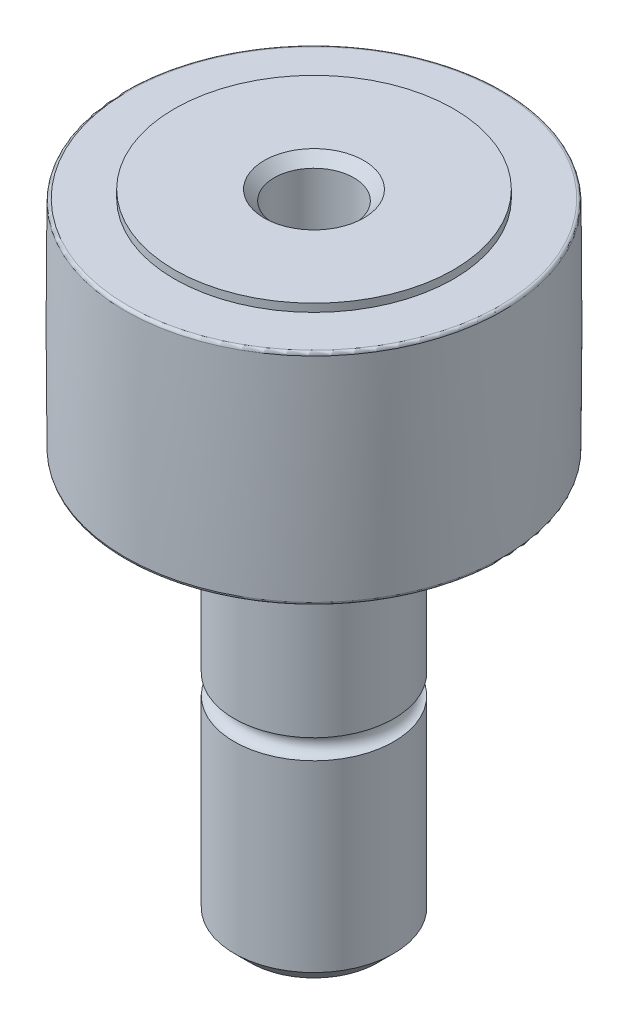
from build123d import *

# Parameters (mm, degrees)
CHANFREIN1_SIZE = 0.8
PER_AGE1_D      = 3
PER_AGE1_DEPTH  = 10
PER_AGE1_TIP    = 0.866025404
PER_AGE2_D      = 4
PER_AGE2_DEPTH  = 6
PER_AGE2_TIP    = 1.154700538
CONG_1_R        = 0.15
CHANFREIN2_SIZE = 0.5


with BuildPart() as part:
    # Esquisse1 → Base-R_volution (revolve)
    with BuildSketch(Plane.XY, mode=Mode.PRIVATE) as base_r_volution_sk:
        with BuildLine():
            Line((0, 0), (4, 0))
            Line((4, 0), (4, 10))
            ThreePointArc((4, 10), (3.5, 10.5), (4, 11))
            Line((4, 11), (4, 20))
            Line((4, 20), (7, 20))
            Line((7, 20), (7, 20.6))
            Line((7, 20.6), (9.469749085, 20.6))
            ThreePointArc((9.469749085, 20.6), (9.5, 26.1), (9.469749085, 31.6))
            Line((9.469749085, 31.6), (7, 31.6))
            Line((7, 31.6), (7, 32))
            Line((7, 32), (0, 32))
            Line((0, 32), (0, 0))
        make_face()
    revolve(base_r_volution_sk.sketch.rotate(Axis((0, -6.89025894, 0), (0, 1, 0)), 90), axis=Axis((0, -6.89025894, 0), (0, 1, 0)))

    # Chanfrein1
    chanfrein1_edges = [part.edges().sort_by_distance(p)[0] for p in [
        (0, 0, 4),
    ]]
    chamfer(chanfrein1_edges, length=CHANFREIN1_SIZE)

    # Per_age1
    with Locations(Plane(origin=(0, 32, 0), x_dir=(-1, 0, 0), z_dir=(0, 1, 0))):
        with Locations((0, 0)):
            Hole(PER_AGE1_D / 2, depth=PER_AGE1_DEPTH)
            with Locations((0, 0, -(PER_AGE1_DEPTH + PER_AGE1_TIP / 2))):  # 120° drill point
                Cone(0, PER_AGE1_D / 2, PER_AGE1_TIP, mode=Mode.SUBTRACT)

    # Per_age2
    with Locations(Plane(origin=(0, 32, 0), x_dir=(-1, 0, 0), z_dir=(0, 1, 0))):
        with Locations((0, 0)):
            Hole(PER_AGE2_D / 2, depth=PER_AGE2_DEPTH)
            with Locations((0, 0, -(PER_AGE2_DEPTH + PER_AGE2_TIP / 2))):  # 120° drill point
                Cone(0, PER_AGE2_D / 2, PER_AGE2_TIP, mode=Mode.SUBTRACT)

    # Cong_1
    cong_1_edges = [part.edges().sort_by_distance(p)[0] for p in [
        (0, 20.6, 9.469749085),
        (0, 31.6, 9.469749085),
    ]]
    fillet(cong_1_edges, radius=CONG_1_R)

    # Chanfrein2
    chanfrein2_edges = [part.edges().sort_by_distance(p)[0] for p in [
        (-2, 32, 0),
    ]]
    chamfer(chanfrein2_edges, length=CHANFREIN2_SIZE)


solid = part.part
